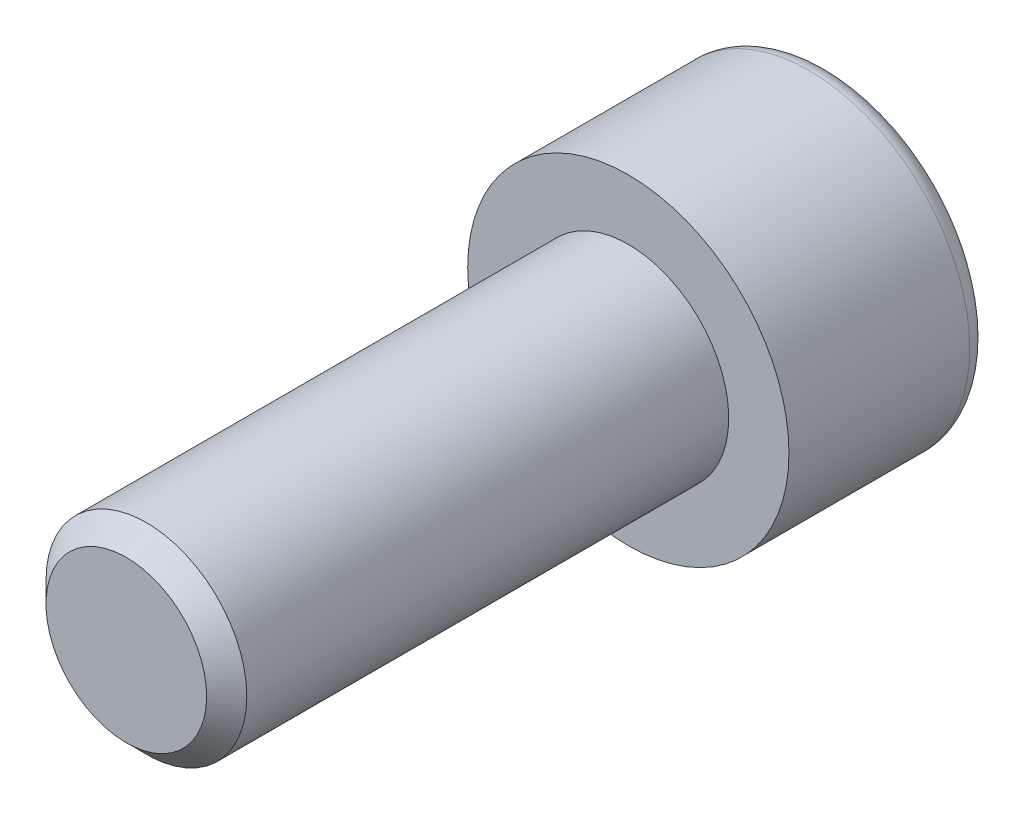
from build123d import *

# Parameters (mm, degrees)
ENLEV_MAT_EXTRU1_DEPTH = 5
ESQUISSE3_W            = 5
ESQUISSE3_H            = 25
CHANFREIN1_SIZE        = 1


with BuildPart() as part:
    # Esquisse1 → Base-R_volution (revolve)
    with BuildSketch(Plane(origin=(0, 0, 0), x_dir=(1, 0, 0), z_dir=(0, 1, 0)), mode=Mode.PRIVATE) as base_r_volution_sk:
        with BuildLine():
            Line((0, 0), (8, 0))
            Line((8, 0), (8, 9))
            ThreePointArc((8, 9), (7.707106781, 9.707106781), (7, 10))
            Line((7, 10), (0, 10))
            Line((0, 10), (0, 0))
        make_face()
    revolve(base_r_volution_sk.sketch.rotate(Axis((0, 0, 0), (0, 0, -1)), 180), axis=Axis((0, 0, 0), (0, 0, -1)))

    # Esquisse2 → enlev-mat-Extru1 (cut)
    with BuildSketch(Plane.XY.offset(-10)):
        Polygon((4, -2.309401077), (4, 2.309401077), (0, 4.618802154), (-4, 2.309401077), (-4, -2.309401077), (0, -4.618802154), align=None)
    extrude(amount=ENLEV_MAT_EXTRU1_DEPTH, mode=Mode.SUBTRACT)

    # Esquisse3 → Boss.-R_vol.1 (revolve)
    with BuildSketch(Plane(origin=(0, 0, 0), x_dir=(1, 0, 0), z_dir=(0, 1, 0))):
        with Locations((2.5, -12.5)):
            Rectangle(ESQUISSE3_W, ESQUISSE3_H)
    revolve(axis=Axis((0, 0, 0), (0, 0, 1)))

    # Chanfrein1
    chanfrein1_edges = [part.edges().sort_by_distance(p)[0] for p in [
        (-5, 0, 25),
    ]]
    chamfer(chanfrein1_edges, length=CHANFREIN1_SIZE)


solid = part.part
